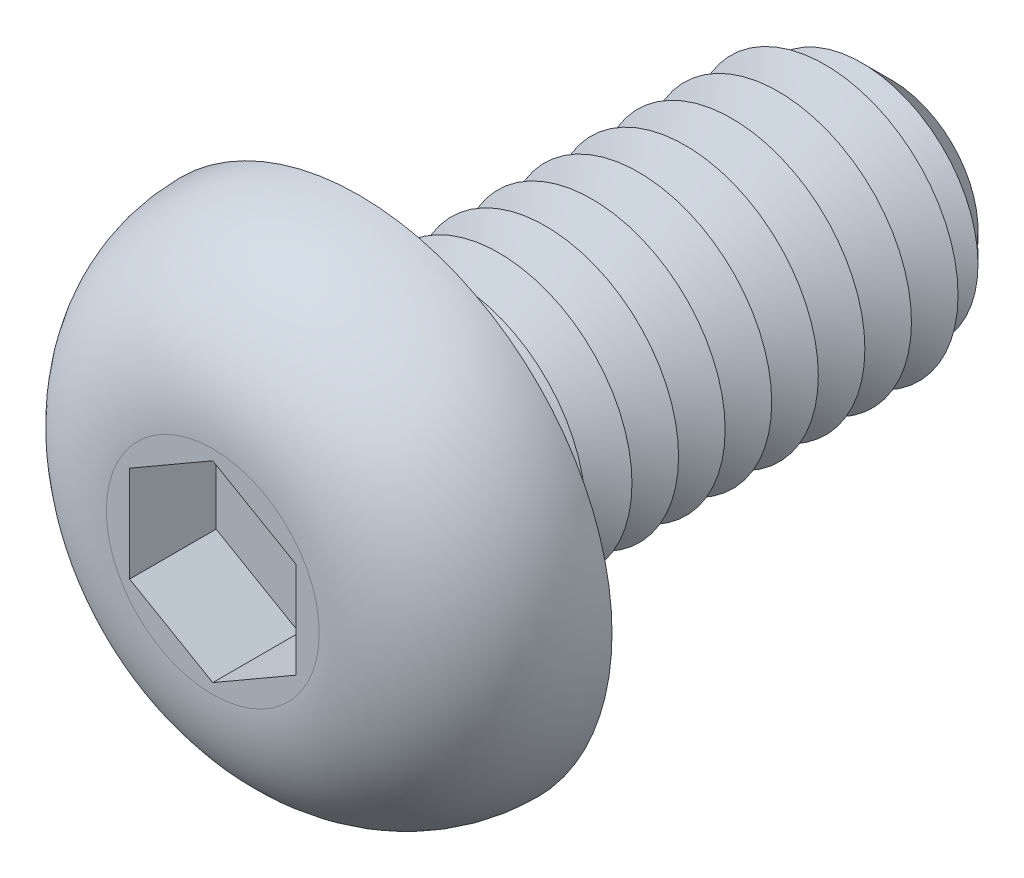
from build123d import *

# Parameters (mm, degrees)
CUT_EXTRUDE1_DEPTH  = 1.3
SKETCH4_R           = 2
BOSS_EXTRUDE1_DEPTH = 8
CHAMFER1_SIZE       = 0.7
LPATTERN1_COUNT     = 10
LPATTERN1_PITCH     = 0.7
FILLET2_R           = 0.35
SKETCH6_R           = 0.5
CUT_EXTRUDE2_DEPTH  = 8.9


with BuildPart() as part:
    # Sketch2 → Revolve1 (revolve)
    with BuildSketch(Plane(origin=(0, 0, 0), x_dir=(0, 0, -1), z_dir=(1, 0, 0)), mode=Mode.PRIVATE) as revolve1_sk:
        with BuildLine():
            Line((0, 0), (-2.2, 0))
            Line((-2.2, 0), (-2.2, 1.6))
            ThreePointArc((-2.2, 1.6), (-1.555634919, 3.155634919), (0, 3.8))
            Line((0, 3.8), (0, 0))
        make_face()
    revolve(revolve1_sk.sketch.rotate(Axis((0, 0, 47.934239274), (0, 0, -1)), 90), axis=Axis((0, 0, 47.934239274), (0, 0, -1)))

    # Sketch3 → Cut-Extrude1 (cut)
    with BuildSketch(Plane.XY.offset(2.2)):
        Polygon((0, 1.443375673), (-1.25, 0.721687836), (-1.25, -0.721687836), (0, -1.443375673), (1.25, -0.721687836), (1.25, 0.721687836), align=None)
    extrude(amount=-CUT_EXTRUDE1_DEPTH, mode=Mode.SUBTRACT)

    # Sketch4 → Boss-Extrude1 (add)
    with BuildSketch(Plane(origin=(0, 0, 0), x_dir=(-1, 0, 0), z_dir=(0, 0, -1))):
        with Locations(Location((0, 0, 0), (0, 0, 180))):
            Circle(SKETCH4_R)
    extrude(amount=BOSS_EXTRUDE1_DEPTH)

    # Chamfer1
    chamfer1_edges = [part.edges().sort_by_distance(p)[0] for p in [
        (-2, 0, -8),
    ]]
    chamfer(chamfer1_edges, length=CHAMFER1_SIZE)

    # Sketch5 → Cut-Revolve1 (revolve, cut)
    with BuildSketch(Plane(origin=(0, 0, 0), x_dir=(0, 0, -1), z_dir=(1, 0, 0)), mode=Mode.PRIVATE) as cut_revolve1_sk:
        Polygon((0.7, 2), (1.4, 2), (1.05, 1.393782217), align=None)
    cut_revolve1 = revolve(cut_revolve1_sk.sketch.rotate(Axis((0, 0, 47.934239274), (0, 0, -1)), 90), axis=Axis((0, 0, 47.934239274), (0, 0, -1)), mode=Mode.SUBTRACT)

    # LPattern1: Cut-Revolve1 ×10
    with Locations(*[(0, 0, -i * LPATTERN1_PITCH) for i in range(1, LPATTERN1_COUNT)]):
        add(cut_revolve1, mode=Mode.SUBTRACT)

    # Fillet2
    fillet2_edges = [part.edges().sort_by_distance(p)[0] for p in [
        (-2, 0, 0),
    ]]
    fillet(fillet2_edges, radius=FILLET2_R)

    # Sketch6 → Cut-Extrude2 (cut)
    with BuildSketch(Plane.XY.offset(0.9)):
        Circle(SKETCH6_R)
    extrude(amount=-CUT_EXTRUDE2_DEPTH, mode=Mode.SUBTRACT)


solid = part.part
